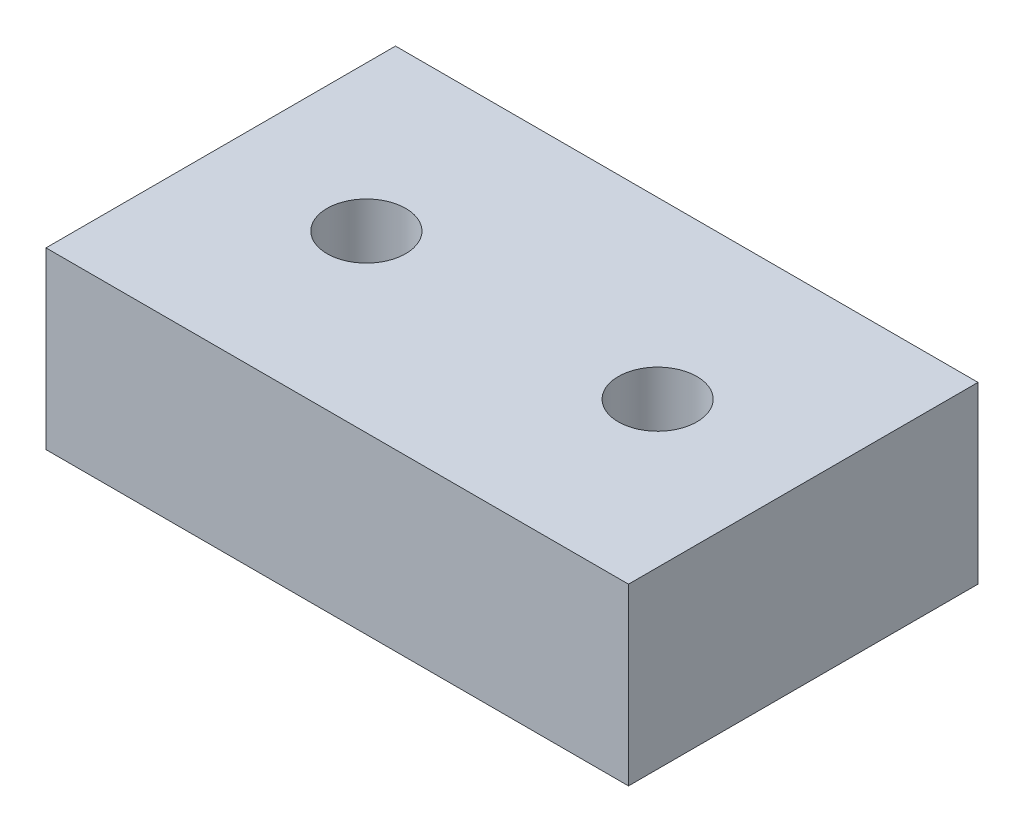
ISO-10303-21;
HEADER;
FILE_DESCRIPTION(('STEP AP214'),'2;1');
FILE_NAME('part.step','',(''),(''),'','','');
FILE_SCHEMA(('AUTOMOTIVE_DESIGN { 1 0 10303 214 1 1 1 1 }'));
ENDSEC;
DATA;
#1=APPLICATION_CONTEXT('core data for automotive mechanical design processes');
#2=APPLICATION_PROTOCOL_DEFINITION('international standard','automotive_design',2000,#1);
#3=PRODUCT_CONTEXT('',#1,'mechanical');
#4=PRODUCT('Part','Part','',(#3));
#5=PRODUCT_RELATED_PRODUCT_CATEGORY('part','',(#4));
#6=PRODUCT_DEFINITION_FORMATION('','',#4);
#7=PRODUCT_DEFINITION_CONTEXT('part definition',#1,'design');
#8=PRODUCT_DEFINITION('design','',#6,#7);
#9=PRODUCT_DEFINITION_SHAPE('','',#8);
#10=(LENGTH_UNIT() NAMED_UNIT(*) SI_UNIT(.MILLI.,.METRE.));
#11=(NAMED_UNIT(*) PLANE_ANGLE_UNIT() SI_UNIT($,.RADIAN.));
#12=(NAMED_UNIT(*) SI_UNIT($,.STERADIAN.) SOLID_ANGLE_UNIT());
#13=UNCERTAINTY_MEASURE_WITH_UNIT(LENGTH_MEASURE(1.E-05),#10,'distance_accuracy_value','');
#14=(GEOMETRIC_REPRESENTATION_CONTEXT(3) GLOBAL_UNCERTAINTY_ASSIGNED_CONTEXT((#13)) GLOBAL_UNIT_ASSIGNED_CONTEXT((#10,
#11,#12)) REPRESENTATION_CONTEXT('',''));
#15=CARTESIAN_POINT('',(0.,0.,0.));
#16=DIRECTION('',(0.,0.,1.));
#17=DIRECTION('',(1.,0.,0.));
#18=AXIS2_PLACEMENT_3D('',#15,#16,#17);
#19=CARTESIAN_POINT('',(0.,30.,0.));
#20=DIRECTION('',(1.,0.,0.));
#21=DIRECTION('',(0.,0.,-1.));
#22=AXIS2_PLACEMENT_3D('',#19,#20,#21);
#23=PLANE('',#22);
#24=DIRECTION('',(0.,0.,1.));
#25=VECTOR('',#24,1.);
#26=CARTESIAN_POINT('',(0.,0.,0.));
#27=LINE('',#26,#25);
#28=CARTESIAN_POINT('',(0.,0.,0.));
#29=VERTEX_POINT('',#28);
#30=CARTESIAN_POINT('',(0.,0.,60.));
#31=VERTEX_POINT('',#30);
#32=EDGE_CURVE('E94',#29,#31,#27,.T.);
#33=ORIENTED_EDGE('',*,*,#32,.T.);
#34=DIRECTION('',(0.,-1.,0.));
#35=VECTOR('',#34,1.);
#36=CARTESIAN_POINT('',(0.,30.,60.));
#37=LINE('',#36,#35);
#38=CARTESIAN_POINT('',(0.,30.,60.));
#39=VERTEX_POINT('',#38);
#40=EDGE_CURVE('E11',#39,#31,#37,.T.);
#41=ORIENTED_EDGE('',*,*,#40,.F.);
#42=DIRECTION('',(0.,0.,1.));
#43=VECTOR('',#42,1.);
#44=CARTESIAN_POINT('',(0.,30.,0.));
#45=LINE('',#44,#43);
#46=CARTESIAN_POINT('',(0.,30.,0.));
#47=VERTEX_POINT('',#46);
#48=EDGE_CURVE('E82',#47,#39,#45,.T.);
#49=ORIENTED_EDGE('',*,*,#48,.F.);
#50=DIRECTION('',(0.,-1.,0.));
#51=VECTOR('',#50,1.);
#52=CARTESIAN_POINT('',(0.,30.,0.));
#53=LINE('',#52,#51);
#54=EDGE_CURVE('E90',#47,#29,#53,.T.);
#55=ORIENTED_EDGE('',*,*,#54,.T.);
#56=EDGE_LOOP('',(#33,#41,#49,#55));
#57=FACE_BOUND('',#56,.T.);
#58=ADVANCED_FACE('F31',(#57),#23,.F.);
#59=CARTESIAN_POINT('',(0.,30.,60.));
#60=DIRECTION('',(0.,0.,-1.));
#61=DIRECTION('',(-1.,0.,0.));
#62=AXIS2_PLACEMENT_3D('',#59,#60,#61);
#63=PLANE('',#62);
#64=DIRECTION('',(1.,0.,0.));
#65=VECTOR('',#64,1.);
#66=CARTESIAN_POINT('',(0.,0.,60.));
#67=LINE('',#66,#65);
#68=CARTESIAN_POINT('',(100.,0.,60.));
#69=VERTEX_POINT('',#68);
#70=EDGE_CURVE('E86',#31,#69,#67,.T.);
#71=ORIENTED_EDGE('',*,*,#70,.T.);
#72=DIRECTION('',(0.,-1.,0.));
#73=VECTOR('',#72,1.);
#74=CARTESIAN_POINT('',(100.,30.,60.));
#75=LINE('',#74,#73);
#76=CARTESIAN_POINT('',(100.,30.,60.));
#77=VERTEX_POINT('',#76);
#78=EDGE_CURVE('E39',#77,#69,#75,.T.);
#79=ORIENTED_EDGE('',*,*,#78,.F.);
#80=DIRECTION('',(1.,0.,0.));
#81=VECTOR('',#80,1.);
#82=CARTESIAN_POINT('',(0.,30.,60.));
#83=LINE('',#82,#81);
#84=EDGE_CURVE('E77',#39,#77,#83,.T.);
#85=ORIENTED_EDGE('',*,*,#84,.F.);
#86=ORIENTED_EDGE('',*,*,#40,.T.);
#87=EDGE_LOOP('',(#71,#79,#85,#86));
#88=FACE_BOUND('',#87,.T.);
#89=ADVANCED_FACE('F85',(#88),#63,.F.);
#90=CARTESIAN_POINT('',(100.,30.,0.));
#91=DIRECTION('',(-1.,0.,0.));
#92=DIRECTION('',(0.,0.,1.));
#93=AXIS2_PLACEMENT_3D('',#90,#91,#92);
#94=PLANE('',#93);
#95=DIRECTION('',(0.,0.,-1.));
#96=VECTOR('',#95,1.);
#97=CARTESIAN_POINT('',(100.,0.,0.));
#98=LINE('',#97,#96);
#99=CARTESIAN_POINT('',(100.,0.,0.));
#100=VERTEX_POINT('',#99);
#101=EDGE_CURVE('E64',#69,#100,#98,.T.);
#102=ORIENTED_EDGE('',*,*,#101,.T.);
#103=DIRECTION('',(0.,-1.,0.));
#104=VECTOR('',#103,1.);
#105=CARTESIAN_POINT('',(100.,30.,0.));
#106=LINE('',#105,#104);
#107=CARTESIAN_POINT('',(100.,30.,0.));
#108=VERTEX_POINT('',#107);
#109=EDGE_CURVE('E87',#108,#100,#106,.T.);
#110=ORIENTED_EDGE('',*,*,#109,.F.);
#111=DIRECTION('',(0.,0.,-1.));
#112=VECTOR('',#111,1.);
#113=CARTESIAN_POINT('',(100.,30.,0.));
#114=LINE('',#113,#112);
#115=EDGE_CURVE('E80',#77,#108,#114,.T.);
#116=ORIENTED_EDGE('',*,*,#115,.F.);
#117=ORIENTED_EDGE('',*,*,#78,.T.);
#118=EDGE_LOOP('',(#102,#110,#116,#117));
#119=FACE_BOUND('',#118,.T.);
#120=ADVANCED_FACE('F88',(#119),#94,.F.);
#121=CARTESIAN_POINT('',(0.,30.,0.));
#122=DIRECTION('',(0.,0.,1.));
#123=DIRECTION('',(1.,0.,0.));
#124=AXIS2_PLACEMENT_3D('',#121,#122,#123);
#125=PLANE('',#124);
#126=DIRECTION('',(-1.,0.,0.));
#127=VECTOR('',#126,1.);
#128=CARTESIAN_POINT('',(0.,0.,0.));
#129=LINE('',#128,#127);
#130=EDGE_CURVE('E70',#100,#29,#129,.T.);
#131=ORIENTED_EDGE('',*,*,#130,.T.);
#132=ORIENTED_EDGE('',*,*,#54,.F.);
#133=DIRECTION('',(-1.,0.,0.));
#134=VECTOR('',#133,1.);
#135=CARTESIAN_POINT('',(0.,30.,0.));
#136=LINE('',#135,#134);
#137=EDGE_CURVE('E47',#108,#47,#136,.T.);
#138=ORIENTED_EDGE('',*,*,#137,.F.);
#139=ORIENTED_EDGE('',*,*,#109,.T.);
#140=EDGE_LOOP('',(#131,#132,#138,#139));
#141=FACE_BOUND('',#140,.T.);
#142=ADVANCED_FACE('F102',(#141),#125,.F.);
#143=CARTESIAN_POINT('',(0.,30.,60.));
#144=DIRECTION('',(0.,1.,0.));
#145=DIRECTION('',(0.,0.,1.));
#146=AXIS2_PLACEMENT_3D('',#143,#144,#145);
#147=PLANE('',#146);
#148=CARTESIAN_POINT('',(75.,30.,30.));
#149=DIRECTION('',(0.,-1.,0.));
#150=DIRECTION('',(0.,0.,-1.));
#151=AXIS2_PLACEMENT_3D('',#148,#149,#150);
#152=CIRCLE('',#151,6.74999999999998);
#153=CARTESIAN_POINT('',(75.,30.,23.25));
#154=VERTEX_POINT('',#153);
#155=EDGE_CURVE('E113',#154,#154,#152,.T.);
#156=ORIENTED_EDGE('',*,*,#155,.T.);
#157=EDGE_LOOP('',(#156));
#158=FACE_BOUND('',#157,.T.);
#159=CARTESIAN_POINT('',(25.,30.,30.));
#160=DIRECTION('',(0.,-1.,0.));
#161=DIRECTION('',(0.,0.,-1.));
#162=AXIS2_PLACEMENT_3D('',#159,#160,#161);
#163=CIRCLE('',#162,6.74999999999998);
#164=CARTESIAN_POINT('',(25.,30.,23.25));
#165=VERTEX_POINT('',#164);
#166=EDGE_CURVE('E97',#165,#165,#163,.T.);
#167=ORIENTED_EDGE('',*,*,#166,.T.);
#168=EDGE_LOOP('',(#167));
#169=FACE_BOUND('',#168,.T.);
#170=ORIENTED_EDGE('',*,*,#48,.T.);
#171=ORIENTED_EDGE('',*,*,#84,.T.);
#172=ORIENTED_EDGE('',*,*,#115,.T.);
#173=ORIENTED_EDGE('',*,*,#137,.T.);
#174=EDGE_LOOP('',(#170,#171,#172,#173));
#175=FACE_BOUND('',#174,.T.);
#176=ADVANCED_FACE('F78',(#158,#169,#175),#147,.T.);
#177=CARTESIAN_POINT('',(0.,0.,60.));
#178=DIRECTION('',(0.,1.,0.));
#179=DIRECTION('',(0.,0.,1.));
#180=AXIS2_PLACEMENT_3D('',#177,#178,#179);
#181=PLANE('',#180);
#182=CARTESIAN_POINT('',(75.,0.,30.));
#183=DIRECTION('',(0.,-1.,0.));
#184=DIRECTION('',(0.,0.,-1.));
#185=AXIS2_PLACEMENT_3D('',#182,#183,#184);
#186=CIRCLE('',#185,6.74999999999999);
#187=CARTESIAN_POINT('',(75.,0.,23.25));
#188=VERTEX_POINT('',#187);
#189=EDGE_CURVE('E116',#188,#188,#186,.T.);
#190=ORIENTED_EDGE('',*,*,#189,.F.);
#191=EDGE_LOOP('',(#190));
#192=FACE_BOUND('',#191,.T.);
#193=CARTESIAN_POINT('',(25.,0.,30.));
#194=DIRECTION('',(0.,-1.,0.));
#195=DIRECTION('',(0.,0.,-1.));
#196=AXIS2_PLACEMENT_3D('',#193,#194,#195);
#197=CIRCLE('',#196,6.74999999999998);
#198=CARTESIAN_POINT('',(25.,0.,23.25));
#199=VERTEX_POINT('',#198);
#200=EDGE_CURVE('E110',#199,#199,#197,.T.);
#201=ORIENTED_EDGE('',*,*,#200,.F.);
#202=EDGE_LOOP('',(#201));
#203=FACE_BOUND('',#202,.T.);
#204=ORIENTED_EDGE('',*,*,#32,.F.);
#205=ORIENTED_EDGE('',*,*,#130,.F.);
#206=ORIENTED_EDGE('',*,*,#101,.F.);
#207=ORIENTED_EDGE('',*,*,#70,.F.);
#208=EDGE_LOOP('',(#204,#205,#206,#207));
#209=FACE_BOUND('',#208,.T.);
#210=ADVANCED_FACE('F105',(#192,#203,#209),#181,.F.);
#211=CARTESIAN_POINT('',(25.,0.,30.));
#212=DIRECTION('',(0.,-1.,0.));
#213=DIRECTION('',(0.,0.,-1.));
#214=AXIS2_PLACEMENT_3D('',#211,#212,#213);
#215=CYLINDRICAL_SURFACE('',#214,6.74999999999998);
#216=ORIENTED_EDGE('',*,*,#166,.F.);
#217=EDGE_LOOP('',(#216));
#218=FACE_BOUND('',#217,.T.);
#219=ORIENTED_EDGE('',*,*,#200,.T.);
#220=EDGE_LOOP('',(#219));
#221=FACE_BOUND('',#220,.T.);
#222=ADVANCED_FACE('F124',(#218,#221),#215,.F.);
#223=CARTESIAN_POINT('',(75.,0.,30.));
#224=DIRECTION('',(0.,-1.,0.));
#225=DIRECTION('',(0.,0.,-1.));
#226=AXIS2_PLACEMENT_3D('',#223,#224,#225);
#227=CYLINDRICAL_SURFACE('',#226,6.74999999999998);
#228=ORIENTED_EDGE('',*,*,#155,.F.);
#229=EDGE_LOOP('',(#228));
#230=FACE_BOUND('',#229,.T.);
#231=ORIENTED_EDGE('',*,*,#189,.T.);
#232=EDGE_LOOP('',(#231));
#233=FACE_BOUND('',#232,.T.);
#234=ADVANCED_FACE('F120',(#230,#233),#227,.F.);
#235=CLOSED_SHELL('',(#58,#89,#120,#142,#176,#210,#222,#234));
#236=MANIFOLD_SOLID_BREP('B2',#235);
#237=ADVANCED_BREP_SHAPE_REPRESENTATION('',(#18,#236),#14);
#238=SHAPE_DEFINITION_REPRESENTATION(#9,#237);
ENDSEC;
END-ISO-10303-21;
